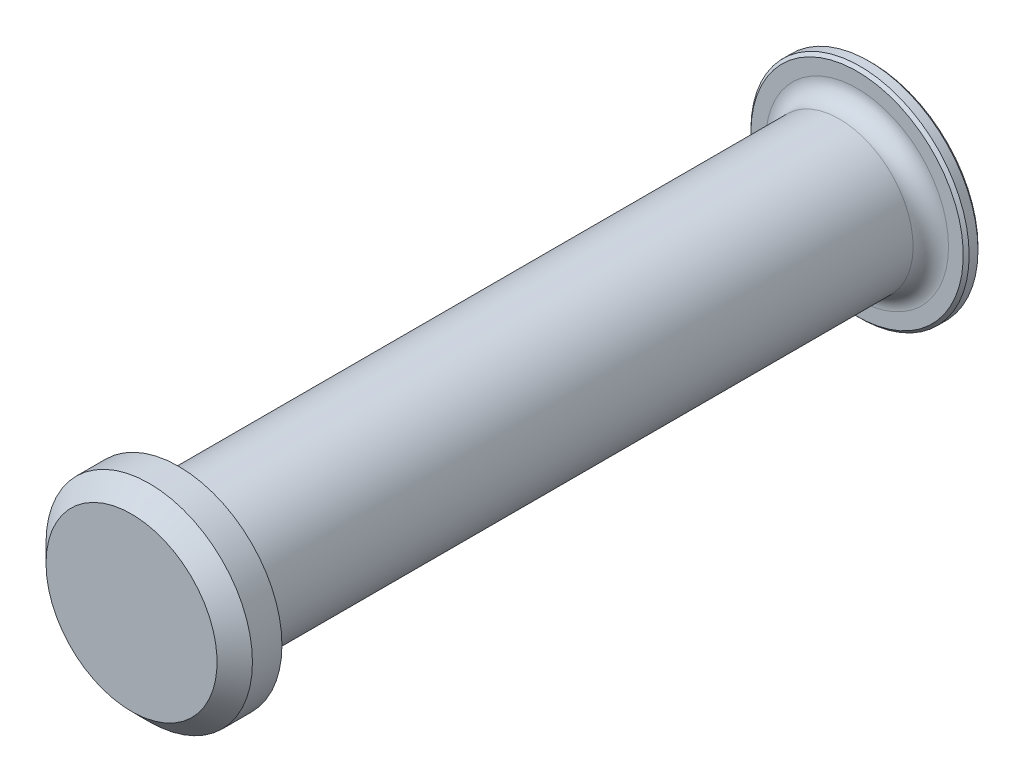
ISO-10303-21;
HEADER;
FILE_DESCRIPTION(('STEP AP214'),'2;1');
FILE_NAME('part.step','',(''),(''),'','','');
FILE_SCHEMA(('AUTOMOTIVE_DESIGN { 1 0 10303 214 1 1 1 1 }'));
ENDSEC;
DATA;
#1=APPLICATION_CONTEXT('core data for automotive mechanical design processes');
#2=APPLICATION_PROTOCOL_DEFINITION('international standard','automotive_design',2000,#1);
#3=PRODUCT_CONTEXT('',#1,'mechanical');
#4=PRODUCT('Part','Part','',(#3));
#5=PRODUCT_RELATED_PRODUCT_CATEGORY('part','',(#4));
#6=PRODUCT_DEFINITION_FORMATION('','',#4);
#7=PRODUCT_DEFINITION_CONTEXT('part definition',#1,'design');
#8=PRODUCT_DEFINITION('design','',#6,#7);
#9=PRODUCT_DEFINITION_SHAPE('','',#8);
#10=(LENGTH_UNIT() NAMED_UNIT(*) SI_UNIT(.MILLI.,.METRE.));
#11=(NAMED_UNIT(*) PLANE_ANGLE_UNIT() SI_UNIT($,.RADIAN.));
#12=(NAMED_UNIT(*) SI_UNIT($,.STERADIAN.) SOLID_ANGLE_UNIT());
#13=UNCERTAINTY_MEASURE_WITH_UNIT(LENGTH_MEASURE(1.E-05),#10,'distance_accuracy_value','');
#14=(GEOMETRIC_REPRESENTATION_CONTEXT(3) GLOBAL_UNCERTAINTY_ASSIGNED_CONTEXT((#13)) GLOBAL_UNIT_ASSIGNED_CONTEXT((#10,
#11,#12)) REPRESENTATION_CONTEXT('',''));
#15=CARTESIAN_POINT('',(0.,0.,0.));
#16=DIRECTION('',(0.,0.,1.));
#17=DIRECTION('',(1.,0.,0.));
#18=AXIS2_PLACEMENT_3D('',#15,#16,#17);
#19=CARTESIAN_POINT('',(0.,0.,-7.49999999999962));
#20=DIRECTION('',(0.,0.,-1.));
#21=DIRECTION('',(-1.,0.,0.));
#22=AXIS2_PLACEMENT_3D('',#19,#20,#21);
#23=CONICAL_SURFACE('',#22,0.999999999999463,1.04719755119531);
#24=CARTESIAN_POINT('',(1.11022302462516E-12,0.,-6.92264973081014));
#25=VERTEX_POINT('',#24);
#26=VERTEX_LOOP('',#25);
#27=FACE_BOUND('',#26,.T.);
#28=CARTESIAN_POINT('',(0.,0.,-7.49999999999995));
#29=DIRECTION('',(0.,0.,1.));
#30=DIRECTION('',(1.,0.,0.));
#31=AXIS2_PLACEMENT_3D('',#28,#29,#30);
#32=CIRCLE('',#31,1.);
#33=CARTESIAN_POINT('',(1.00000000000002,0.,-7.49999999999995));
#34=VERTEX_POINT('',#33);
#35=EDGE_CURVE('E103',#34,#34,#32,.F.);
#36=ORIENTED_EDGE('',*,*,#35,.T.);
#37=EDGE_LOOP('',(#36));
#38=FACE_BOUND('',#37,.T.);
#39=ADVANCED_FACE('F17',(#27,#38),#23,.F.);
#40=CARTESIAN_POINT('',(3.49191704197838E-12,0.,987.7));
#41=DIRECTION('',(0.,0.,1.));
#42=DIRECTION('',(1.,0.,0.));
#43=AXIS2_PLACEMENT_3D('',#40,#41,#42);
#44=CYLINDRICAL_SURFACE('',#43,1.);
#45=ORIENTED_EDGE('',*,*,#35,.F.);
#46=EDGE_LOOP('',(#45));
#47=FACE_BOUND('',#46,.T.);
#48=CARTESIAN_POINT('',(0.,0.,-11.2));
#49=DIRECTION('',(0.,0.,1.));
#50=DIRECTION('',(1.,0.,0.));
#51=AXIS2_PLACEMENT_3D('',#48,#49,#50);
#52=CIRCLE('',#51,1.);
#53=CARTESIAN_POINT('',(1.,0.,-11.2));
#54=VERTEX_POINT('',#53);
#55=EDGE_CURVE('E60',#54,#54,#52,.T.);
#56=ORIENTED_EDGE('',*,*,#55,.F.);
#57=EDGE_LOOP('',(#56));
#58=FACE_BOUND('',#57,.T.);
#59=ADVANCED_FACE('F90',(#47,#58),#44,.F.);
#60=CARTESIAN_POINT('',(0.,0.,-11.2));
#61=DIRECTION('',(0.,0.,1.));
#62=DIRECTION('',(1.,0.,0.));
#63=AXIS2_PLACEMENT_3D('',#60,#61,#62);
#64=TOROIDAL_SURFACE('',#63,1.55,0.55);
#65=ORIENTED_EDGE('',*,*,#55,.T.);
#66=EDGE_LOOP('',(#65));
#67=FACE_BOUND('',#66,.T.);
#68=CARTESIAN_POINT('',(0.,0.,-11.75));
#69=DIRECTION('',(0.,0.,-1.));
#70=DIRECTION('',(1.,0.,0.));
#71=AXIS2_PLACEMENT_3D('',#68,#69,#70);
#72=CIRCLE('',#71,1.55);
#73=CARTESIAN_POINT('',(-1.55,0.,-11.75));
#74=VERTEX_POINT('',#73);
#75=CARTESIAN_POINT('',(1.55,0.,-11.75));
#76=VERTEX_POINT('',#75);
#77=EDGE_CURVE('E47',#74,#76,#72,.F.);
#78=ORIENTED_EDGE('',*,*,#77,.F.);
#79=CARTESIAN_POINT('',(0.,0.,-11.75));
#80=DIRECTION('',(0.,0.,-1.));
#81=DIRECTION('',(-1.,0.,0.));
#82=AXIS2_PLACEMENT_3D('',#79,#80,#81);
#83=CIRCLE('',#82,1.55);
#84=EDGE_CURVE('E51',#76,#74,#83,.F.);
#85=ORIENTED_EDGE('',*,*,#84,.F.);
#86=EDGE_LOOP('',(#78,#85));
#87=FACE_BOUND('',#86,.T.);
#88=ADVANCED_FACE('F50',(#67,#87),#64,.T.);
#89=CARTESIAN_POINT('',(1.85,0.,-11.75));
#90=DIRECTION('',(0.,0.,-1.));
#91=DIRECTION('',(-1.,0.,0.));
#92=AXIS2_PLACEMENT_3D('',#89,#90,#91);
#93=PLANE('',#92);
#94=ORIENTED_EDGE('',*,*,#84,.T.);
#95=ORIENTED_EDGE('',*,*,#77,.T.);
#96=EDGE_LOOP('',(#94,#95));
#97=FACE_BOUND('',#96,.T.);
#98=CARTESIAN_POINT('',(0.,0.,-11.7499999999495));
#99=DIRECTION('',(0.,0.,1.));
#100=DIRECTION('',(1.,0.,0.));
#101=AXIS2_PLACEMENT_3D('',#98,#99,#100);
#102=CIRCLE('',#101,1.80000000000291);
#103=CARTESIAN_POINT('',(1.80000000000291,0.,-11.7499999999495));
#104=VERTEX_POINT('',#103);
#105=EDGE_CURVE('E54',#104,#104,#102,.T.);
#106=ORIENTED_EDGE('',*,*,#105,.F.);
#107=EDGE_LOOP('',(#106));
#108=FACE_BOUND('',#107,.T.);
#109=ADVANCED_FACE('F58',(#97,#108),#93,.T.);
#110=CARTESIAN_POINT('',(0.,0.,-11.7000000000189));
#111=DIRECTION('',(0.,0.,1.));
#112=DIRECTION('',(1.,0.,0.));
#113=AXIS2_PLACEMENT_3D('',#110,#111,#112);
#114=CONICAL_SURFACE('',#113,1.84999999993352,0.785398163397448);
#115=CARTESIAN_POINT('',(0.,0.,-11.7));
#116=DIRECTION('',(0.,0.,1.));
#117=DIRECTION('',(1.,0.,0.));
#118=AXIS2_PLACEMENT_3D('',#115,#116,#117);
#119=CIRCLE('',#118,1.85);
#120=CARTESIAN_POINT('',(1.85,0.,-11.7));
#121=VERTEX_POINT('',#120);
#122=EDGE_CURVE('E63',#121,#121,#119,.T.);
#123=ORIENTED_EDGE('',*,*,#122,.F.);
#124=EDGE_LOOP('',(#123));
#125=FACE_BOUND('',#124,.T.);
#126=ORIENTED_EDGE('',*,*,#105,.T.);
#127=EDGE_LOOP('',(#126));
#128=FACE_BOUND('',#127,.T.);
#129=ADVANCED_FACE('F77',(#125,#128),#114,.T.);
#130=CARTESIAN_POINT('',(0.,0.,-11.));
#131=DIRECTION('',(0.,0.,1.));
#132=DIRECTION('',(1.,0.,0.));
#133=AXIS2_PLACEMENT_3D('',#130,#131,#132);
#134=CYLINDRICAL_SURFACE('',#133,1.85);
#135=CARTESIAN_POINT('',(0.,0.,-11.5499999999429));
#136=DIRECTION('',(0.,0.,-1.));
#137=DIRECTION('',(-1.,0.,0.));
#138=AXIS2_PLACEMENT_3D('',#135,#136,#137);
#139=CIRCLE('',#138,1.84999999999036);
#140=CARTESIAN_POINT('',(-1.84999999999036,0.,-11.5499999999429));
#141=VERTEX_POINT('',#140);
#142=EDGE_CURVE('E116',#141,#141,#139,.F.);
#143=ORIENTED_EDGE('',*,*,#142,.F.);
#144=EDGE_LOOP('',(#143));
#145=FACE_BOUND('',#144,.T.);
#146=ORIENTED_EDGE('',*,*,#122,.T.);
#147=EDGE_LOOP('',(#146));
#148=FACE_BOUND('',#147,.T.);
#149=ADVANCED_FACE('F185',(#145,#148),#134,.T.);
#150=CARTESIAN_POINT('',(0.,0.,0.8));
#151=DIRECTION('',(0.,0.,1.));
#152=DIRECTION('',(1.,0.,0.));
#153=AXIS2_PLACEMENT_3D('',#150,#151,#152);
#154=PLANE('',#153);
#155=CARTESIAN_POINT('',(0.,0.,0.799999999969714));
#156=DIRECTION('',(0.,0.,-1.));
#157=DIRECTION('',(-1.,0.,0.));
#158=AXIS2_PLACEMENT_3D('',#155,#156,#157);
#159=CIRCLE('',#158,1.44999999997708);
#160=CARTESIAN_POINT('',(-1.44999999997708,0.,0.799999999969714));
#161=VERTEX_POINT('',#160);
#162=EDGE_CURVE('E113',#161,#161,#159,.T.);
#163=ORIENTED_EDGE('',*,*,#162,.F.);
#164=EDGE_LOOP('',(#163));
#165=FACE_BOUND('',#164,.T.);
#166=ADVANCED_FACE('F194',(#165),#154,.T.);
#167=CARTESIAN_POINT('',(0.,0.,-11.5499999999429));
#168=DIRECTION('',(0.,0.,-1.));
#169=DIRECTION('',(-1.,0.,0.));
#170=AXIS2_PLACEMENT_3D('',#167,#168,#169);
#171=CONICAL_SURFACE('',#170,1.84999999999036,0.785398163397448);
#172=ORIENTED_EDGE('',*,*,#142,.T.);
#173=EDGE_LOOP('',(#172));
#174=FACE_BOUND('',#173,.T.);
#175=CARTESIAN_POINT('',(0.,0.,-11.5000000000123));
#176=DIRECTION('',(0.,0.,-1.));
#177=DIRECTION('',(-1.,0.,0.));
#178=AXIS2_PLACEMENT_3D('',#175,#176,#177);
#179=CIRCLE('',#178,1.80000000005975);
#180=CARTESIAN_POINT('',(-1.80000000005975,0.,-11.5000000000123));
#181=VERTEX_POINT('',#180);
#182=EDGE_CURVE('E109',#181,#181,#179,.F.);
#183=ORIENTED_EDGE('',*,*,#182,.F.);
#184=EDGE_LOOP('',(#183));
#185=FACE_BOUND('',#184,.T.);
#186=ADVANCED_FACE('F217',(#174,#185),#171,.T.);
#187=CARTESIAN_POINT('',(0.,0.,0.50000000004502));
#188=DIRECTION('',(0.,0.,-1.));
#189=DIRECTION('',(-1.,0.,0.));
#190=AXIS2_PLACEMENT_3D('',#187,#188,#189);
#191=CONICAL_SURFACE('',#190,1.74999999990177,0.785398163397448);
#192=ORIENTED_EDGE('',*,*,#162,.T.);
#193=EDGE_LOOP('',(#192));
#194=FACE_BOUND('',#193,.T.);
#195=CARTESIAN_POINT('',(0.,0.,0.499999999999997));
#196=DIRECTION('',(0.,0.,-1.));
#197=DIRECTION('',(-1.,0.,0.));
#198=AXIS2_PLACEMENT_3D('',#195,#196,#197);
#199=CIRCLE('',#198,1.75);
#200=CARTESIAN_POINT('',(-1.75,0.,0.499999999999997));
#201=VERTEX_POINT('',#200);
#202=EDGE_CURVE('E112',#201,#201,#199,.T.);
#203=ORIENTED_EDGE('',*,*,#202,.F.);
#204=EDGE_LOOP('',(#203));
#205=FACE_BOUND('',#204,.T.);
#206=ADVANCED_FACE('F159',(#194,#205),#191,.T.);
#207=CARTESIAN_POINT('',(1.55,0.,-11.5));
#208=DIRECTION('',(0.,0.,1.));
#209=DIRECTION('',(1.,0.,0.));
#210=AXIS2_PLACEMENT_3D('',#207,#208,#209);
#211=PLANE('',#210);
#212=CARTESIAN_POINT('',(0.,0.,-11.5));
#213=DIRECTION('',(0.,0.,1.));
#214=DIRECTION('',(1.,0.,0.));
#215=AXIS2_PLACEMENT_3D('',#212,#213,#214);
#216=CIRCLE('',#215,1.55);
#217=CARTESIAN_POINT('',(-1.55,0.,-11.5));
#218=VERTEX_POINT('',#217);
#219=CARTESIAN_POINT('',(1.55,0.,-11.5));
#220=VERTEX_POINT('',#219);
#221=EDGE_CURVE('E36',#218,#220,#216,.F.);
#222=ORIENTED_EDGE('',*,*,#221,.T.);
#223=CARTESIAN_POINT('',(0.,0.,-11.5));
#224=DIRECTION('',(0.,0.,1.));
#225=DIRECTION('',(-1.,0.,0.));
#226=AXIS2_PLACEMENT_3D('',#223,#224,#225);
#227=CIRCLE('',#226,1.55);
#228=EDGE_CURVE('E121',#220,#218,#227,.F.);
#229=ORIENTED_EDGE('',*,*,#228,.T.);
#230=EDGE_LOOP('',(#222,#229));
#231=FACE_BOUND('',#230,.T.);
#232=ORIENTED_EDGE('',*,*,#182,.T.);
#233=EDGE_LOOP('',(#232));
#234=FACE_BOUND('',#233,.T.);
#235=ADVANCED_FACE('F150',(#231,#234),#211,.T.);
#236=CARTESIAN_POINT('',(0.,0.,0.8));
#237=DIRECTION('',(0.,0.,-1.));
#238=DIRECTION('',(-1.,0.,0.));
#239=AXIS2_PLACEMENT_3D('',#236,#237,#238);
#240=CYLINDRICAL_SURFACE('',#239,1.75);
#241=ORIENTED_EDGE('',*,*,#202,.T.);
#242=EDGE_LOOP('',(#241));
#243=FACE_BOUND('',#242,.T.);
#244=CARTESIAN_POINT('',(0.,0.,0.));
#245=DIRECTION('',(0.,0.,-1.));
#246=DIRECTION('',(-1.,0.,0.));
#247=AXIS2_PLACEMENT_3D('',#244,#245,#246);
#248=CIRCLE('',#247,1.75);
#249=CARTESIAN_POINT('',(-1.75,0.,0.));
#250=VERTEX_POINT('',#249);
#251=EDGE_CURVE('E106',#250,#250,#248,.F.);
#252=ORIENTED_EDGE('',*,*,#251,.T.);
#253=EDGE_LOOP('',(#252));
#254=FACE_BOUND('',#253,.T.);
#255=ADVANCED_FACE('F137',(#243,#254),#240,.T.);
#256=CARTESIAN_POINT('',(0.,0.,-11.2));
#257=DIRECTION('',(0.,0.,1.));
#258=DIRECTION('',(1.,0.,0.));
#259=AXIS2_PLACEMENT_3D('',#256,#257,#258);
#260=TOROIDAL_SURFACE('',#259,1.55,0.3);
#261=CARTESIAN_POINT('',(0.,0.,-11.2));
#262=DIRECTION('',(0.,0.,1.));
#263=DIRECTION('',(1.,0.,0.));
#264=AXIS2_PLACEMENT_3D('',#261,#262,#263);
#265=CIRCLE('',#264,1.25);
#266=CARTESIAN_POINT('',(1.25,0.,-11.2));
#267=VERTEX_POINT('',#266);
#268=EDGE_CURVE('E28',#267,#267,#265,.T.);
#269=ORIENTED_EDGE('',*,*,#268,.F.);
#270=EDGE_LOOP('',(#269));
#271=FACE_BOUND('',#270,.T.);
#272=ORIENTED_EDGE('',*,*,#228,.F.);
#273=ORIENTED_EDGE('',*,*,#221,.F.);
#274=EDGE_LOOP('',(#272,#273));
#275=FACE_BOUND('',#274,.T.);
#276=ADVANCED_FACE('F125',(#271,#275),#260,.F.);
#277=CARTESIAN_POINT('',(0.,0.,0.));
#278=DIRECTION('',(0.,0.,1.));
#279=DIRECTION('',(1.,0.,0.));
#280=AXIS2_PLACEMENT_3D('',#277,#278,#279);
#281=PLANE('',#280);
#282=CARTESIAN_POINT('',(0.,0.,0.));
#283=DIRECTION('',(0.,0.,1.));
#284=DIRECTION('',(1.,0.,0.));
#285=AXIS2_PLACEMENT_3D('',#282,#283,#284);
#286=CIRCLE('',#285,1.25);
#287=CARTESIAN_POINT('',(1.25,0.,0.));
#288=VERTEX_POINT('',#287);
#289=EDGE_CURVE('E11',#288,#288,#286,.F.);
#290=ORIENTED_EDGE('',*,*,#289,.F.);
#291=EDGE_LOOP('',(#290));
#292=FACE_BOUND('',#291,.T.);
#293=ORIENTED_EDGE('',*,*,#251,.F.);
#294=EDGE_LOOP('',(#293));
#295=FACE_BOUND('',#294,.T.);
#296=ADVANCED_FACE('F136',(#292,#295),#281,.F.);
#297=CARTESIAN_POINT('',(0.,0.,-11.));
#298=DIRECTION('',(0.,0.,1.));
#299=DIRECTION('',(1.,0.,0.));
#300=AXIS2_PLACEMENT_3D('',#297,#298,#299);
#301=CYLINDRICAL_SURFACE('',#300,1.25);
#302=ORIENTED_EDGE('',*,*,#289,.T.);
#303=EDGE_LOOP('',(#302));
#304=FACE_BOUND('',#303,.T.);
#305=ORIENTED_EDGE('',*,*,#268,.T.);
#306=EDGE_LOOP('',(#305));
#307=FACE_BOUND('',#306,.T.);
#308=ADVANCED_FACE('F196',(#304,#307),#301,.T.);
#309=CLOSED_SHELL('',(#39,#59,#88,#109,#129,#149,#166,#186,#206,#235,#255,#276,#296,#308));
#310=MANIFOLD_SOLID_BREP('B1',#309);
#311=ADVANCED_BREP_SHAPE_REPRESENTATION('',(#18,#310),#14);
#312=SHAPE_DEFINITION_REPRESENTATION(#9,#311);
ENDSEC;
END-ISO-10303-21;
